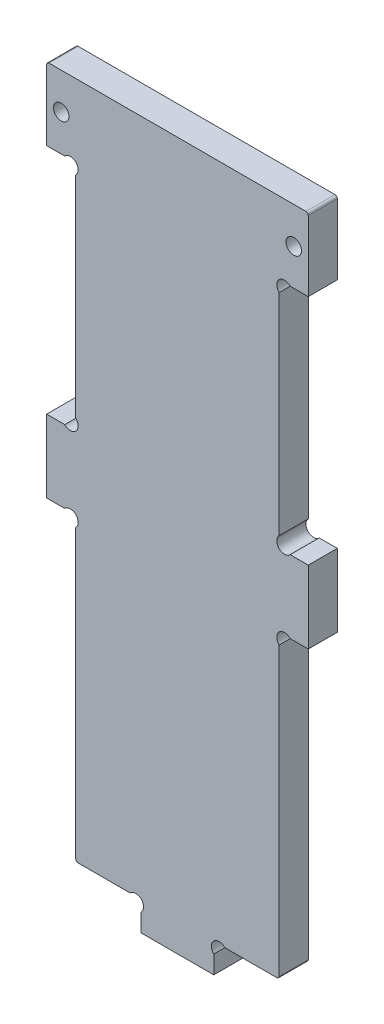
ISO-10303-21;
HEADER;
FILE_DESCRIPTION(('STEP AP214'),'2;1');
FILE_NAME('part.step','',(''),(''),'','','');
FILE_SCHEMA(('AUTOMOTIVE_DESIGN { 1 0 10303 214 1 1 1 1 }'));
ENDSEC;
DATA;
#1=APPLICATION_CONTEXT('core data for automotive mechanical design processes');
#2=APPLICATION_PROTOCOL_DEFINITION('international standard','automotive_design',2000,#1);
#3=PRODUCT_CONTEXT('',#1,'mechanical');
#4=PRODUCT('Part','Part','',(#3));
#5=PRODUCT_RELATED_PRODUCT_CATEGORY('part','',(#4));
#6=PRODUCT_DEFINITION_FORMATION('','',#4);
#7=PRODUCT_DEFINITION_CONTEXT('part definition',#1,'design');
#8=PRODUCT_DEFINITION('design','',#6,#7);
#9=PRODUCT_DEFINITION_SHAPE('','',#8);
#10=(LENGTH_UNIT() NAMED_UNIT(*) SI_UNIT(.MILLI.,.METRE.));
#11=(NAMED_UNIT(*) PLANE_ANGLE_UNIT() SI_UNIT($,.RADIAN.));
#12=(NAMED_UNIT(*) SI_UNIT($,.STERADIAN.) SOLID_ANGLE_UNIT());
#13=UNCERTAINTY_MEASURE_WITH_UNIT(LENGTH_MEASURE(1.E-05),#10,'distance_accuracy_value','');
#14=(GEOMETRIC_REPRESENTATION_CONTEXT(3) GLOBAL_UNCERTAINTY_ASSIGNED_CONTEXT((#13)) GLOBAL_UNIT_ASSIGNED_CONTEXT((#10,
#11,#12)) REPRESENTATION_CONTEXT('',''));
#15=CARTESIAN_POINT('',(0.,0.,0.));
#16=DIRECTION('',(0.,0.,1.));
#17=DIRECTION('',(1.,0.,0.));
#18=AXIS2_PLACEMENT_3D('',#15,#16,#17);
#19=CARTESIAN_POINT('',(-77.,7.,-6.));
#20=DIRECTION('',(-1.,0.,0.));
#21=DIRECTION('',(0.,0.,1.));
#22=AXIS2_PLACEMENT_3D('',#19,#20,#21);
#23=PLANE('',#22);
#24=DIRECTION('',(0.,-1.,0.));
#25=VECTOR('',#24,1.);
#26=CARTESIAN_POINT('',(-77.,7.,0.));
#27=LINE('',#26,#25);
#28=CARTESIAN_POINT('',(-77.,7.,0.));
#29=VERTEX_POINT('',#28);
#30=CARTESIAN_POINT('',(-77.,-8.,0.));
#31=VERTEX_POINT('',#30);
#32=EDGE_CURVE('E243',#29,#31,#27,.T.);
#33=ORIENTED_EDGE('',*,*,#32,.F.);
#34=DIRECTION('',(0.,0.,1.));
#35=VECTOR('',#34,1.);
#36=CARTESIAN_POINT('',(-77.,7.,-6.));
#37=LINE('',#36,#35);
#38=CARTESIAN_POINT('',(-77.,7.,-6.));
#39=VERTEX_POINT('',#38);
#40=EDGE_CURVE('E11',#39,#29,#37,.T.);
#41=ORIENTED_EDGE('',*,*,#40,.F.);
#42=DIRECTION('',(0.,-1.,0.));
#43=VECTOR('',#42,1.);
#44=CARTESIAN_POINT('',(-77.,7.,-6.));
#45=LINE('',#44,#43);
#46=CARTESIAN_POINT('',(-77.,-8.,-6.));
#47=VERTEX_POINT('',#46);
#48=EDGE_CURVE('E245',#39,#47,#45,.T.);
#49=ORIENTED_EDGE('',*,*,#48,.T.);
#50=DIRECTION('',(0.,0.,1.));
#51=VECTOR('',#50,1.);
#52=CARTESIAN_POINT('',(-77.,-8.,-6.));
#53=LINE('',#52,#51);
#54=EDGE_CURVE('E38',#47,#31,#53,.T.);
#55=ORIENTED_EDGE('',*,*,#54,.T.);
#56=EDGE_LOOP('',(#33,#41,#49,#55));
#57=FACE_BOUND('',#56,.T.);
#58=ADVANCED_FACE('F35',(#57),#23,.T.);
#59=CARTESIAN_POINT('',(-73.2618950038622,7.,-6.));
#60=DIRECTION('',(0.,1.,0.));
#61=DIRECTION('',(0.,0.,1.));
#62=AXIS2_PLACEMENT_3D('',#59,#60,#61);
#63=PLANE('',#62);
#64=DIRECTION('',(-1.,0.,0.));
#65=VECTOR('',#64,1.);
#66=CARTESIAN_POINT('',(-73.2618950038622,7.,0.));
#67=LINE('',#66,#65);
#68=CARTESIAN_POINT('',(-73.2618950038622,7.,0.));
#69=VERTEX_POINT('',#68);
#70=EDGE_CURVE('E261',#69,#29,#67,.T.);
#71=ORIENTED_EDGE('',*,*,#70,.F.);
#72=DIRECTION('',(0.,0.,1.));
#73=VECTOR('',#72,1.);
#74=CARTESIAN_POINT('',(-73.2618950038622,7.,-6.));
#75=LINE('',#74,#73);
#76=CARTESIAN_POINT('',(-73.2618950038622,7.,-6.));
#77=VERTEX_POINT('',#76);
#78=EDGE_CURVE('E43',#77,#69,#75,.T.);
#79=ORIENTED_EDGE('',*,*,#78,.F.);
#80=DIRECTION('',(-1.,0.,0.));
#81=VECTOR('',#80,1.);
#82=CARTESIAN_POINT('',(-73.2618950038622,7.,-6.));
#83=LINE('',#82,#81);
#84=EDGE_CURVE('E250',#77,#39,#83,.T.);
#85=ORIENTED_EDGE('',*,*,#84,.T.);
#86=ORIENTED_EDGE('',*,*,#40,.T.);
#87=EDGE_LOOP('',(#71,#79,#85,#86));
#88=FACE_BOUND('',#87,.T.);
#89=ADVANCED_FACE('F615',(#88),#63,.T.);
#90=CARTESIAN_POINT('',(-72.1,8.1,-6.));
#91=DIRECTION('',(0.,0.,1.));
#92=DIRECTION('',(1.,0.,0.));
#93=AXIS2_PLACEMENT_3D('',#90,#91,#92);
#94=CYLINDRICAL_SURFACE('',#93,1.6);
#95=CARTESIAN_POINT('',(-72.1,8.1,0.));
#96=DIRECTION('',(0.,0.,-1.));
#97=DIRECTION('',(-1.,0.,0.));
#98=AXIS2_PLACEMENT_3D('',#95,#96,#97);
#99=CIRCLE('',#98,1.6);
#100=CARTESIAN_POINT('',(-71.,9.26189500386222,0.));
#101=VERTEX_POINT('',#100);
#102=EDGE_CURVE('E351',#101,#69,#99,.T.);
#103=ORIENTED_EDGE('',*,*,#102,.F.);
#104=DIRECTION('',(0.,0.,1.));
#105=VECTOR('',#104,1.);
#106=CARTESIAN_POINT('',(-71.,9.26189500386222,-6.));
#107=LINE('',#106,#105);
#108=CARTESIAN_POINT('',(-71.,9.26189500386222,-6.));
#109=VERTEX_POINT('',#108);
#110=EDGE_CURVE('E445',#109,#101,#107,.T.);
#111=ORIENTED_EDGE('',*,*,#110,.F.);
#112=CARTESIAN_POINT('',(-72.1,8.1,-6.));
#113=DIRECTION('',(0.,0.,-1.));
#114=DIRECTION('',(-1.,0.,0.));
#115=AXIS2_PLACEMENT_3D('',#112,#113,#114);
#116=CIRCLE('',#115,1.6);
#117=EDGE_CURVE('E441',#109,#77,#116,.T.);
#118=ORIENTED_EDGE('',*,*,#117,.T.);
#119=ORIENTED_EDGE('',*,*,#78,.T.);
#120=EDGE_LOOP('',(#103,#111,#118,#119));
#121=FACE_BOUND('',#120,.T.);
#122=ADVANCED_FACE('F614',(#121),#94,.F.);
#123=CARTESIAN_POINT('',(-71.,52.7381049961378,-6.));
#124=DIRECTION('',(-1.,0.,0.));
#125=DIRECTION('',(0.,0.,1.));
#126=AXIS2_PLACEMENT_3D('',#123,#124,#125);
#127=PLANE('',#126);
#128=DIRECTION('',(0.,-1.,0.));
#129=VECTOR('',#128,1.);
#130=CARTESIAN_POINT('',(-71.,52.7381049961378,0.));
#131=LINE('',#130,#129);
#132=CARTESIAN_POINT('',(-71.,52.7381049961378,0.));
#133=VERTEX_POINT('',#132);
#134=EDGE_CURVE('E348',#133,#101,#131,.T.);
#135=ORIENTED_EDGE('',*,*,#134,.F.);
#136=DIRECTION('',(0.,0.,1.));
#137=VECTOR('',#136,1.);
#138=CARTESIAN_POINT('',(-71.,52.7381049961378,-6.));
#139=LINE('',#138,#137);
#140=CARTESIAN_POINT('',(-71.,52.7381049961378,-6.));
#141=VERTEX_POINT('',#140);
#142=EDGE_CURVE('E447',#141,#133,#139,.T.);
#143=ORIENTED_EDGE('',*,*,#142,.F.);
#144=DIRECTION('',(0.,-1.,0.));
#145=VECTOR('',#144,1.);
#146=CARTESIAN_POINT('',(-71.,52.7381049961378,-6.));
#147=LINE('',#146,#145);
#148=EDGE_CURVE('E438',#141,#109,#147,.T.);
#149=ORIENTED_EDGE('',*,*,#148,.T.);
#150=ORIENTED_EDGE('',*,*,#110,.T.);
#151=EDGE_LOOP('',(#135,#143,#149,#150));
#152=FACE_BOUND('',#151,.T.);
#153=ADVANCED_FACE('F610',(#152),#127,.T.);
#154=CARTESIAN_POINT('',(-72.1,53.9,-6.));
#155=DIRECTION('',(0.,0.,1.));
#156=DIRECTION('',(1.,0.,0.));
#157=AXIS2_PLACEMENT_3D('',#154,#155,#156);
#158=CYLINDRICAL_SURFACE('',#157,1.59999999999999);
#159=CARTESIAN_POINT('',(-72.1,53.9,0.));
#160=DIRECTION('',(0.,0.,-1.));
#161=DIRECTION('',(-1.,0.,0.));
#162=AXIS2_PLACEMENT_3D('',#159,#160,#161);
#163=CIRCLE('',#162,1.59999999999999);
#164=CARTESIAN_POINT('',(-73.2618950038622,55.,0.));
#165=VERTEX_POINT('',#164);
#166=EDGE_CURVE('E345',#165,#133,#163,.T.);
#167=ORIENTED_EDGE('',*,*,#166,.F.);
#168=DIRECTION('',(0.,0.,1.));
#169=VECTOR('',#168,1.);
#170=CARTESIAN_POINT('',(-73.2618950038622,55.,-6.));
#171=LINE('',#170,#169);
#172=CARTESIAN_POINT('',(-73.2618950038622,55.,-6.));
#173=VERTEX_POINT('',#172);
#174=EDGE_CURVE('E449',#173,#165,#171,.T.);
#175=ORIENTED_EDGE('',*,*,#174,.F.);
#176=CARTESIAN_POINT('',(-72.1,53.9,-6.));
#177=DIRECTION('',(0.,0.,-1.));
#178=DIRECTION('',(-1.,0.,0.));
#179=AXIS2_PLACEMENT_3D('',#176,#177,#178);
#180=CIRCLE('',#179,1.59999999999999);
#181=EDGE_CURVE('E435',#173,#141,#180,.T.);
#182=ORIENTED_EDGE('',*,*,#181,.T.);
#183=ORIENTED_EDGE('',*,*,#142,.T.);
#184=EDGE_LOOP('',(#167,#175,#182,#183));
#185=FACE_BOUND('',#184,.T.);
#186=ADVANCED_FACE('F606',(#185),#158,.F.);
#187=CARTESIAN_POINT('',(-77.,55.,-6.));
#188=DIRECTION('',(0.,-1.,0.));
#189=DIRECTION('',(0.,0.,-1.));
#190=AXIS2_PLACEMENT_3D('',#187,#188,#189);
#191=PLANE('',#190);
#192=DIRECTION('',(1.,0.,0.));
#193=VECTOR('',#192,1.);
#194=CARTESIAN_POINT('',(-77.,55.,0.));
#195=LINE('',#194,#193);
#196=CARTESIAN_POINT('',(-77.,55.,0.));
#197=VERTEX_POINT('',#196);
#198=EDGE_CURVE('E342',#197,#165,#195,.T.);
#199=ORIENTED_EDGE('',*,*,#198,.F.);
#200=DIRECTION('',(0.,0.,1.));
#201=VECTOR('',#200,1.);
#202=CARTESIAN_POINT('',(-77.,55.,-6.));
#203=LINE('',#202,#201);
#204=CARTESIAN_POINT('',(-77.,55.,-6.));
#205=VERTEX_POINT('',#204);
#206=EDGE_CURVE('E451',#205,#197,#203,.T.);
#207=ORIENTED_EDGE('',*,*,#206,.F.);
#208=DIRECTION('',(1.,0.,0.));
#209=VECTOR('',#208,1.);
#210=CARTESIAN_POINT('',(-77.,55.,-6.));
#211=LINE('',#210,#209);
#212=EDGE_CURVE('E432',#205,#173,#211,.T.);
#213=ORIENTED_EDGE('',*,*,#212,.T.);
#214=ORIENTED_EDGE('',*,*,#174,.T.);
#215=EDGE_LOOP('',(#199,#207,#213,#214));
#216=FACE_BOUND('',#215,.T.);
#217=ADVANCED_FACE('F602',(#216),#191,.T.);
#218=CARTESIAN_POINT('',(-77.,69.5,-6.));
#219=DIRECTION('',(-1.,0.,0.));
#220=DIRECTION('',(0.,0.,1.));
#221=AXIS2_PLACEMENT_3D('',#218,#219,#220);
#222=PLANE('',#221);
#223=DIRECTION('',(0.,-1.,0.));
#224=VECTOR('',#223,1.);
#225=CARTESIAN_POINT('',(-77.,69.5,0.));
#226=LINE('',#225,#224);
#227=CARTESIAN_POINT('',(-77.,69.5,0.));
#228=VERTEX_POINT('',#227);
#229=EDGE_CURVE('E339',#228,#197,#226,.T.);
#230=ORIENTED_EDGE('',*,*,#229,.F.);
#231=DIRECTION('',(0.,0.,1.));
#232=VECTOR('',#231,1.);
#233=CARTESIAN_POINT('',(-77.,69.5,-6.));
#234=LINE('',#233,#232);
#235=CARTESIAN_POINT('',(-77.,69.5,-6.));
#236=VERTEX_POINT('',#235);
#237=EDGE_CURVE('E453',#236,#228,#234,.T.);
#238=ORIENTED_EDGE('',*,*,#237,.F.);
#239=DIRECTION('',(0.,-1.,0.));
#240=VECTOR('',#239,1.);
#241=CARTESIAN_POINT('',(-77.,69.5,-6.));
#242=LINE('',#241,#240);
#243=EDGE_CURVE('E429',#236,#205,#242,.T.);
#244=ORIENTED_EDGE('',*,*,#243,.T.);
#245=ORIENTED_EDGE('',*,*,#206,.T.);
#246=EDGE_LOOP('',(#230,#238,#244,#245));
#247=FACE_BOUND('',#246,.T.);
#248=ADVANCED_FACE('F598',(#247),#222,.T.);
#249=CARTESIAN_POINT('',(-76.5,69.5,-6.));
#250=DIRECTION('',(0.,0.,1.));
#251=DIRECTION('',(1.,0.,0.));
#252=AXIS2_PLACEMENT_3D('',#249,#250,#251);
#253=CYLINDRICAL_SURFACE('',#252,0.5);
#254=CARTESIAN_POINT('',(-76.5,69.5,0.));
#255=DIRECTION('',(0.,0.,1.));
#256=DIRECTION('',(1.,0.,0.));
#257=AXIS2_PLACEMENT_3D('',#254,#255,#256);
#258=CIRCLE('',#257,0.5);
#259=CARTESIAN_POINT('',(-76.5,70.,0.));
#260=VERTEX_POINT('',#259);
#261=EDGE_CURVE('E336',#260,#228,#258,.T.);
#262=ORIENTED_EDGE('',*,*,#261,.F.);
#263=DIRECTION('',(0.,0.,1.));
#264=VECTOR('',#263,1.);
#265=CARTESIAN_POINT('',(-76.5,70.,-6.));
#266=LINE('',#265,#264);
#267=CARTESIAN_POINT('',(-76.5,70.,-6.));
#268=VERTEX_POINT('',#267);
#269=EDGE_CURVE('E455',#268,#260,#266,.T.);
#270=ORIENTED_EDGE('',*,*,#269,.F.);
#271=CARTESIAN_POINT('',(-76.5,69.5,-6.));
#272=DIRECTION('',(0.,0.,1.));
#273=DIRECTION('',(1.,0.,0.));
#274=AXIS2_PLACEMENT_3D('',#271,#272,#273);
#275=CIRCLE('',#274,0.5);
#276=EDGE_CURVE('E426',#268,#236,#275,.T.);
#277=ORIENTED_EDGE('',*,*,#276,.T.);
#278=ORIENTED_EDGE('',*,*,#237,.T.);
#279=EDGE_LOOP('',(#262,#270,#277,#278));
#280=FACE_BOUND('',#279,.T.);
#281=ADVANCED_FACE('F594',(#280),#253,.T.);
#282=CARTESIAN_POINT('',(-76.5,70.,-6.));
#283=DIRECTION('',(0.,1.,0.));
#284=DIRECTION('',(0.,0.,1.));
#285=AXIS2_PLACEMENT_3D('',#282,#283,#284);
#286=PLANE('',#285);
#287=DIRECTION('',(-1.,0.,0.));
#288=VECTOR('',#287,1.);
#289=CARTESIAN_POINT('',(-76.5,70.,0.));
#290=LINE('',#289,#288);
#291=CARTESIAN_POINT('',(-23.5,70.,0.));
#292=VERTEX_POINT('',#291);
#293=EDGE_CURVE('E333',#292,#260,#290,.T.);
#294=ORIENTED_EDGE('',*,*,#293,.F.);
#295=DIRECTION('',(0.,0.,1.));
#296=VECTOR('',#295,1.);
#297=CARTESIAN_POINT('',(-23.5,70.,-6.));
#298=LINE('',#297,#296);
#299=CARTESIAN_POINT('',(-23.5,70.,-6.));
#300=VERTEX_POINT('',#299);
#301=EDGE_CURVE('E457',#300,#292,#298,.T.);
#302=ORIENTED_EDGE('',*,*,#301,.F.);
#303=DIRECTION('',(-1.,0.,0.));
#304=VECTOR('',#303,1.);
#305=CARTESIAN_POINT('',(-76.5,70.,-6.));
#306=LINE('',#305,#304);
#307=EDGE_CURVE('E423',#300,#268,#306,.T.);
#308=ORIENTED_EDGE('',*,*,#307,.T.);
#309=ORIENTED_EDGE('',*,*,#269,.T.);
#310=EDGE_LOOP('',(#294,#302,#308,#309));
#311=FACE_BOUND('',#310,.T.);
#312=ADVANCED_FACE('F590',(#311),#286,.T.);
#313=CARTESIAN_POINT('',(-23.5,69.5,-6.));
#314=DIRECTION('',(0.,0.,1.));
#315=DIRECTION('',(1.,0.,0.));
#316=AXIS2_PLACEMENT_3D('',#313,#314,#315);
#317=CYLINDRICAL_SURFACE('',#316,0.5);
#318=CARTESIAN_POINT('',(-23.5,69.5,0.));
#319=DIRECTION('',(0.,0.,1.));
#320=DIRECTION('',(-1.,0.,0.));
#321=AXIS2_PLACEMENT_3D('',#318,#319,#320);
#322=CIRCLE('',#321,0.5);
#323=CARTESIAN_POINT('',(-23.,69.5,0.));
#324=VERTEX_POINT('',#323);
#325=EDGE_CURVE('E330',#324,#292,#322,.T.);
#326=ORIENTED_EDGE('',*,*,#325,.F.);
#327=DIRECTION('',(0.,0.,1.));
#328=VECTOR('',#327,1.);
#329=CARTESIAN_POINT('',(-23.,69.5,-6.));
#330=LINE('',#329,#328);
#331=CARTESIAN_POINT('',(-23.,69.5,-6.));
#332=VERTEX_POINT('',#331);
#333=EDGE_CURVE('E459',#332,#324,#330,.T.);
#334=ORIENTED_EDGE('',*,*,#333,.F.);
#335=CARTESIAN_POINT('',(-23.5,69.5,-6.));
#336=DIRECTION('',(0.,0.,1.));
#337=DIRECTION('',(-1.,0.,0.));
#338=AXIS2_PLACEMENT_3D('',#335,#336,#337);
#339=CIRCLE('',#338,0.5);
#340=EDGE_CURVE('E420',#332,#300,#339,.T.);
#341=ORIENTED_EDGE('',*,*,#340,.T.);
#342=ORIENTED_EDGE('',*,*,#301,.T.);
#343=EDGE_LOOP('',(#326,#334,#341,#342));
#344=FACE_BOUND('',#343,.T.);
#345=ADVANCED_FACE('F586',(#344),#317,.T.);
#346=CARTESIAN_POINT('',(-23.,69.5,-6.));
#347=DIRECTION('',(1.,0.,0.));
#348=DIRECTION('',(0.,0.,-1.));
#349=AXIS2_PLACEMENT_3D('',#346,#347,#348);
#350=PLANE('',#349);
#351=DIRECTION('',(0.,1.,0.));
#352=VECTOR('',#351,1.);
#353=CARTESIAN_POINT('',(-23.,69.5,0.));
#354=LINE('',#353,#352);
#355=CARTESIAN_POINT('',(-23.,55.,0.));
#356=VERTEX_POINT('',#355);
#357=EDGE_CURVE('E327',#356,#324,#354,.T.);
#358=ORIENTED_EDGE('',*,*,#357,.F.);
#359=DIRECTION('',(0.,0.,1.));
#360=VECTOR('',#359,1.);
#361=CARTESIAN_POINT('',(-23.,55.,-6.));
#362=LINE('',#361,#360);
#363=CARTESIAN_POINT('',(-23.,55.,-6.));
#364=VERTEX_POINT('',#363);
#365=EDGE_CURVE('E461',#364,#356,#362,.T.);
#366=ORIENTED_EDGE('',*,*,#365,.F.);
#367=DIRECTION('',(0.,1.,0.));
#368=VECTOR('',#367,1.);
#369=CARTESIAN_POINT('',(-23.,69.5,-6.));
#370=LINE('',#369,#368);
#371=EDGE_CURVE('E417',#364,#332,#370,.T.);
#372=ORIENTED_EDGE('',*,*,#371,.T.);
#373=ORIENTED_EDGE('',*,*,#333,.T.);
#374=EDGE_LOOP('',(#358,#366,#372,#373));
#375=FACE_BOUND('',#374,.T.);
#376=ADVANCED_FACE('F582',(#375),#350,.T.);
#377=CARTESIAN_POINT('',(-23.,55.,-6.));
#378=DIRECTION('',(0.,-1.,0.));
#379=DIRECTION('',(0.,0.,-1.));
#380=AXIS2_PLACEMENT_3D('',#377,#378,#379);
#381=PLANE('',#380);
#382=DIRECTION('',(1.,0.,0.));
#383=VECTOR('',#382,1.);
#384=CARTESIAN_POINT('',(-23.,55.,0.));
#385=LINE('',#384,#383);
#386=CARTESIAN_POINT('',(-26.7381049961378,55.,0.));
#387=VERTEX_POINT('',#386);
#388=EDGE_CURVE('E324',#387,#356,#385,.T.);
#389=ORIENTED_EDGE('',*,*,#388,.F.);
#390=DIRECTION('',(0.,0.,1.));
#391=VECTOR('',#390,1.);
#392=CARTESIAN_POINT('',(-26.7381049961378,55.,-6.));
#393=LINE('',#392,#391);
#394=CARTESIAN_POINT('',(-26.7381049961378,55.,-6.));
#395=VERTEX_POINT('',#394);
#396=EDGE_CURVE('E463',#395,#387,#393,.T.);
#397=ORIENTED_EDGE('',*,*,#396,.F.);
#398=DIRECTION('',(1.,0.,0.));
#399=VECTOR('',#398,1.);
#400=CARTESIAN_POINT('',(-23.,55.,-6.));
#401=LINE('',#400,#399);
#402=EDGE_CURVE('E414',#395,#364,#401,.T.);
#403=ORIENTED_EDGE('',*,*,#402,.T.);
#404=ORIENTED_EDGE('',*,*,#365,.T.);
#405=EDGE_LOOP('',(#389,#397,#403,#404));
#406=FACE_BOUND('',#405,.T.);
#407=ADVANCED_FACE('F578',(#406),#381,.T.);
#408=CARTESIAN_POINT('',(-27.9,53.9,-6.));
#409=DIRECTION('',(0.,0.,1.));
#410=DIRECTION('',(1.,0.,0.));
#411=AXIS2_PLACEMENT_3D('',#408,#409,#410);
#412=CYLINDRICAL_SURFACE('',#411,1.59999999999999);
#413=CARTESIAN_POINT('',(-27.9,53.9,0.));
#414=DIRECTION('',(0.,0.,-1.));
#415=DIRECTION('',(1.,0.,0.));
#416=AXIS2_PLACEMENT_3D('',#413,#414,#415);
#417=CIRCLE('',#416,1.59999999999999);
#418=CARTESIAN_POINT('',(-29.,52.7381049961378,0.));
#419=VERTEX_POINT('',#418);
#420=EDGE_CURVE('E321',#419,#387,#417,.T.);
#421=ORIENTED_EDGE('',*,*,#420,.F.);
#422=DIRECTION('',(0.,0.,1.));
#423=VECTOR('',#422,1.);
#424=CARTESIAN_POINT('',(-29.,52.7381049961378,-6.));
#425=LINE('',#424,#423);
#426=CARTESIAN_POINT('',(-29.,52.7381049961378,-6.));
#427=VERTEX_POINT('',#426);
#428=EDGE_CURVE('E465',#427,#419,#425,.T.);
#429=ORIENTED_EDGE('',*,*,#428,.F.);
#430=CARTESIAN_POINT('',(-27.9,53.9,-6.));
#431=DIRECTION('',(0.,0.,-1.));
#432=DIRECTION('',(1.,0.,0.));
#433=AXIS2_PLACEMENT_3D('',#430,#431,#432);
#434=CIRCLE('',#433,1.59999999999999);
#435=EDGE_CURVE('E411',#427,#395,#434,.T.);
#436=ORIENTED_EDGE('',*,*,#435,.T.);
#437=ORIENTED_EDGE('',*,*,#396,.T.);
#438=EDGE_LOOP('',(#421,#429,#436,#437));
#439=FACE_BOUND('',#438,.T.);
#440=ADVANCED_FACE('F574',(#439),#412,.F.);
#441=CARTESIAN_POINT('',(-29.,52.7381049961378,-6.));
#442=DIRECTION('',(1.,0.,0.));
#443=DIRECTION('',(0.,1.,0.));
#444=AXIS2_PLACEMENT_3D('',#441,#442,#443);
#445=PLANE('',#444);
#446=DIRECTION('',(0.,1.,0.));
#447=VECTOR('',#446,1.);
#448=CARTESIAN_POINT('',(-29.,52.7381049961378,0.));
#449=LINE('',#448,#447);
#450=CARTESIAN_POINT('',(-29.,9.26189500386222,0.));
#451=VERTEX_POINT('',#450);
#452=EDGE_CURVE('E318',#451,#419,#449,.T.);
#453=ORIENTED_EDGE('',*,*,#452,.F.);
#454=DIRECTION('',(0.,0.,1.));
#455=VECTOR('',#454,1.);
#456=CARTESIAN_POINT('',(-29.,9.26189500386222,-6.));
#457=LINE('',#456,#455);
#458=CARTESIAN_POINT('',(-29.,9.26189500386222,-6.));
#459=VERTEX_POINT('',#458);
#460=EDGE_CURVE('E467',#459,#451,#457,.T.);
#461=ORIENTED_EDGE('',*,*,#460,.F.);
#462=DIRECTION('',(0.,1.,0.));
#463=VECTOR('',#462,1.);
#464=CARTESIAN_POINT('',(-29.,52.7381049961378,-6.));
#465=LINE('',#464,#463);
#466=EDGE_CURVE('E408',#459,#427,#465,.T.);
#467=ORIENTED_EDGE('',*,*,#466,.T.);
#468=ORIENTED_EDGE('',*,*,#428,.T.);
#469=EDGE_LOOP('',(#453,#461,#467,#468));
#470=FACE_BOUND('',#469,.T.);
#471=ADVANCED_FACE('F570',(#470),#445,.T.);
#472=CARTESIAN_POINT('',(-27.9,8.1,-6.));
#473=DIRECTION('',(0.,0.,1.));
#474=DIRECTION('',(1.,0.,0.));
#475=AXIS2_PLACEMENT_3D('',#472,#473,#474);
#476=CYLINDRICAL_SURFACE('',#475,1.6);
#477=CARTESIAN_POINT('',(-27.9,8.1,0.));
#478=DIRECTION('',(0.,0.,-1.));
#479=DIRECTION('',(1.,0.,0.));
#480=AXIS2_PLACEMENT_3D('',#477,#478,#479);
#481=CIRCLE('',#480,1.6);
#482=CARTESIAN_POINT('',(-26.7381049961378,7.,0.));
#483=VERTEX_POINT('',#482);
#484=EDGE_CURVE('E315',#483,#451,#481,.T.);
#485=ORIENTED_EDGE('',*,*,#484,.F.);
#486=DIRECTION('',(0.,0.,1.));
#487=VECTOR('',#486,1.);
#488=CARTESIAN_POINT('',(-26.7381049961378,7.,-6.));
#489=LINE('',#488,#487);
#490=CARTESIAN_POINT('',(-26.7381049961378,7.,-6.));
#491=VERTEX_POINT('',#490);
#492=EDGE_CURVE('E469',#491,#483,#489,.T.);
#493=ORIENTED_EDGE('',*,*,#492,.F.);
#494=CARTESIAN_POINT('',(-27.9,8.1,-6.));
#495=DIRECTION('',(0.,0.,-1.));
#496=DIRECTION('',(1.,0.,0.));
#497=AXIS2_PLACEMENT_3D('',#494,#495,#496);
#498=CIRCLE('',#497,1.6);
#499=EDGE_CURVE('E405',#491,#459,#498,.T.);
#500=ORIENTED_EDGE('',*,*,#499,.T.);
#501=ORIENTED_EDGE('',*,*,#460,.T.);
#502=EDGE_LOOP('',(#485,#493,#500,#501));
#503=FACE_BOUND('',#502,.T.);
#504=ADVANCED_FACE('F566',(#503),#476,.F.);
#505=CARTESIAN_POINT('',(-26.7381049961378,7.,-6.));
#506=DIRECTION('',(0.,1.,0.));
#507=DIRECTION('',(0.,0.,1.));
#508=AXIS2_PLACEMENT_3D('',#505,#506,#507);
#509=PLANE('',#508);
#510=DIRECTION('',(-1.,0.,0.));
#511=VECTOR('',#510,1.);
#512=CARTESIAN_POINT('',(-26.7381049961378,7.,0.));
#513=LINE('',#512,#511);
#514=CARTESIAN_POINT('',(-23.,7.,0.));
#515=VERTEX_POINT('',#514);
#516=EDGE_CURVE('E312',#515,#483,#513,.T.);
#517=ORIENTED_EDGE('',*,*,#516,.F.);
#518=DIRECTION('',(0.,0.,1.));
#519=VECTOR('',#518,1.);
#520=CARTESIAN_POINT('',(-23.,7.,-6.));
#521=LINE('',#520,#519);
#522=CARTESIAN_POINT('',(-23.,7.,-6.));
#523=VERTEX_POINT('',#522);
#524=EDGE_CURVE('E471',#523,#515,#521,.T.);
#525=ORIENTED_EDGE('',*,*,#524,.F.);
#526=DIRECTION('',(-1.,0.,0.));
#527=VECTOR('',#526,1.);
#528=CARTESIAN_POINT('',(-26.7381049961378,7.,-6.));
#529=LINE('',#528,#527);
#530=EDGE_CURVE('E402',#523,#491,#529,.T.);
#531=ORIENTED_EDGE('',*,*,#530,.T.);
#532=ORIENTED_EDGE('',*,*,#492,.T.);
#533=EDGE_LOOP('',(#517,#525,#531,#532));
#534=FACE_BOUND('',#533,.T.);
#535=ADVANCED_FACE('F562',(#534),#509,.T.);
#536=CARTESIAN_POINT('',(-23.,7.,-6.));
#537=DIRECTION('',(1.,0.,0.));
#538=DIRECTION('',(0.,0.,-1.));
#539=AXIS2_PLACEMENT_3D('',#536,#537,#538);
#540=PLANE('',#539);
#541=DIRECTION('',(0.,1.,0.));
#542=VECTOR('',#541,1.);
#543=CARTESIAN_POINT('',(-23.,7.,0.));
#544=LINE('',#543,#542);
#545=CARTESIAN_POINT('',(-23.,-8.,0.));
#546=VERTEX_POINT('',#545);
#547=EDGE_CURVE('E309',#546,#515,#544,.T.);
#548=ORIENTED_EDGE('',*,*,#547,.F.);
#549=DIRECTION('',(0.,0.,1.));
#550=VECTOR('',#549,1.);
#551=CARTESIAN_POINT('',(-23.,-8.,-6.));
#552=LINE('',#551,#550);
#553=CARTESIAN_POINT('',(-23.,-8.,-6.));
#554=VERTEX_POINT('',#553);
#555=EDGE_CURVE('E473',#554,#546,#552,.T.);
#556=ORIENTED_EDGE('',*,*,#555,.F.);
#557=DIRECTION('',(0.,1.,0.));
#558=VECTOR('',#557,1.);
#559=CARTESIAN_POINT('',(-23.,7.,-6.));
#560=LINE('',#559,#558);
#561=EDGE_CURVE('E399',#554,#523,#560,.T.);
#562=ORIENTED_EDGE('',*,*,#561,.T.);
#563=ORIENTED_EDGE('',*,*,#524,.T.);
#564=EDGE_LOOP('',(#548,#556,#562,#563));
#565=FACE_BOUND('',#564,.T.);
#566=ADVANCED_FACE('F558',(#565),#540,.T.);
#567=CARTESIAN_POINT('',(-23.,-8.,-6.));
#568=DIRECTION('',(0.,-1.,0.));
#569=DIRECTION('',(0.,0.,-1.));
#570=AXIS2_PLACEMENT_3D('',#567,#568,#569);
#571=PLANE('',#570);
#572=DIRECTION('',(1.,0.,0.));
#573=VECTOR('',#572,1.);
#574=CARTESIAN_POINT('',(-23.,-8.,0.));
#575=LINE('',#574,#573);
#576=CARTESIAN_POINT('',(-26.7381049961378,-8.,0.));
#577=VERTEX_POINT('',#576);
#578=EDGE_CURVE('E306',#577,#546,#575,.T.);
#579=ORIENTED_EDGE('',*,*,#578,.F.);
#580=DIRECTION('',(0.,0.,1.));
#581=VECTOR('',#580,1.);
#582=CARTESIAN_POINT('',(-26.7381049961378,-8.,-6.));
#583=LINE('',#582,#581);
#584=CARTESIAN_POINT('',(-26.7381049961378,-8.,-6.));
#585=VERTEX_POINT('',#584);
#586=EDGE_CURVE('E475',#585,#577,#583,.T.);
#587=ORIENTED_EDGE('',*,*,#586,.F.);
#588=DIRECTION('',(1.,0.,0.));
#589=VECTOR('',#588,1.);
#590=CARTESIAN_POINT('',(-23.,-8.,-6.));
#591=LINE('',#590,#589);
#592=EDGE_CURVE('E396',#585,#554,#591,.T.);
#593=ORIENTED_EDGE('',*,*,#592,.T.);
#594=ORIENTED_EDGE('',*,*,#555,.T.);
#595=EDGE_LOOP('',(#579,#587,#593,#594));
#596=FACE_BOUND('',#595,.T.);
#597=ADVANCED_FACE('F554',(#596),#571,.T.);
#598=CARTESIAN_POINT('',(-27.9,-9.1,-6.));
#599=DIRECTION('',(0.,0.,1.));
#600=DIRECTION('',(1.,0.,0.));
#601=AXIS2_PLACEMENT_3D('',#598,#599,#600);
#602=CYLINDRICAL_SURFACE('',#601,1.6);
#603=CARTESIAN_POINT('',(-27.9,-9.1,0.));
#604=DIRECTION('',(0.,0.,-1.));
#605=DIRECTION('',(-1.,0.,0.));
#606=AXIS2_PLACEMENT_3D('',#603,#604,#605);
#607=CIRCLE('',#606,1.6);
#608=CARTESIAN_POINT('',(-29.,-10.2618950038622,0.));
#609=VERTEX_POINT('',#608);
#610=EDGE_CURVE('E303',#609,#577,#607,.T.);
#611=ORIENTED_EDGE('',*,*,#610,.F.);
#612=DIRECTION('',(0.,0.,1.));
#613=VECTOR('',#612,1.);
#614=CARTESIAN_POINT('',(-29.,-10.2618950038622,-6.));
#615=LINE('',#614,#613);
#616=CARTESIAN_POINT('',(-29.,-10.2618950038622,-6.));
#617=VERTEX_POINT('',#616);
#618=EDGE_CURVE('E477',#617,#609,#615,.T.);
#619=ORIENTED_EDGE('',*,*,#618,.F.);
#620=CARTESIAN_POINT('',(-27.9,-9.1,-6.));
#621=DIRECTION('',(0.,0.,-1.));
#622=DIRECTION('',(-1.,0.,0.));
#623=AXIS2_PLACEMENT_3D('',#620,#621,#622);
#624=CIRCLE('',#623,1.6);
#625=EDGE_CURVE('E393',#617,#585,#624,.T.);
#626=ORIENTED_EDGE('',*,*,#625,.T.);
#627=ORIENTED_EDGE('',*,*,#586,.T.);
#628=EDGE_LOOP('',(#611,#619,#626,#627));
#629=FACE_BOUND('',#628,.T.);
#630=ADVANCED_FACE('F550',(#629),#602,.F.);
#631=CARTESIAN_POINT('',(-29.,-10.2618950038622,-6.));
#632=DIRECTION('',(1.,0.,0.));
#633=DIRECTION('',(0.,1.,0.));
#634=AXIS2_PLACEMENT_3D('',#631,#632,#633);
#635=PLANE('',#634);
#636=DIRECTION('',(0.,1.,0.));
#637=VECTOR('',#636,1.);
#638=CARTESIAN_POINT('',(-29.,-10.2618950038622,0.));
#639=LINE('',#638,#637);
#640=CARTESIAN_POINT('',(-29.,-69.5,0.));
#641=VERTEX_POINT('',#640);
#642=EDGE_CURVE('E300',#641,#609,#639,.T.);
#643=ORIENTED_EDGE('',*,*,#642,.F.);
#644=DIRECTION('',(0.,0.,1.));
#645=VECTOR('',#644,1.);
#646=CARTESIAN_POINT('',(-29.,-69.5,-6.));
#647=LINE('',#646,#645);
#648=CARTESIAN_POINT('',(-29.,-69.5,-6.));
#649=VERTEX_POINT('',#648);
#650=EDGE_CURVE('E479',#649,#641,#647,.T.);
#651=ORIENTED_EDGE('',*,*,#650,.F.);
#652=DIRECTION('',(0.,1.,0.));
#653=VECTOR('',#652,1.);
#654=CARTESIAN_POINT('',(-29.,-10.2618950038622,-6.));
#655=LINE('',#654,#653);
#656=EDGE_CURVE('E390',#649,#617,#655,.T.);
#657=ORIENTED_EDGE('',*,*,#656,.T.);
#658=ORIENTED_EDGE('',*,*,#618,.T.);
#659=EDGE_LOOP('',(#643,#651,#657,#658));
#660=FACE_BOUND('',#659,.T.);
#661=ADVANCED_FACE('F546',(#660),#635,.T.);
#662=CARTESIAN_POINT('',(-29.5,-69.5,-6.));
#663=DIRECTION('',(0.,0.,1.));
#664=DIRECTION('',(1.,0.,0.));
#665=AXIS2_PLACEMENT_3D('',#662,#663,#664);
#666=CYLINDRICAL_SURFACE('',#665,0.5);
#667=CARTESIAN_POINT('',(-29.5,-69.5,0.));
#668=DIRECTION('',(0.,0.,1.));
#669=DIRECTION('',(-1.,0.,0.));
#670=AXIS2_PLACEMENT_3D('',#667,#668,#669);
#671=CIRCLE('',#670,0.5);
#672=CARTESIAN_POINT('',(-29.5,-70.,0.));
#673=VERTEX_POINT('',#672);
#674=EDGE_CURVE('E297',#673,#641,#671,.T.);
#675=ORIENTED_EDGE('',*,*,#674,.F.);
#676=DIRECTION('',(0.,0.,1.));
#677=VECTOR('',#676,1.);
#678=CARTESIAN_POINT('',(-29.5,-70.,-6.));
#679=LINE('',#678,#677);
#680=CARTESIAN_POINT('',(-29.5,-70.,-6.));
#681=VERTEX_POINT('',#680);
#682=EDGE_CURVE('E481',#681,#673,#679,.T.);
#683=ORIENTED_EDGE('',*,*,#682,.F.);
#684=CARTESIAN_POINT('',(-29.5,-69.5,-6.));
#685=DIRECTION('',(0.,0.,1.));
#686=DIRECTION('',(-1.,0.,0.));
#687=AXIS2_PLACEMENT_3D('',#684,#685,#686);
#688=CIRCLE('',#687,0.5);
#689=EDGE_CURVE('E387',#681,#649,#688,.T.);
#690=ORIENTED_EDGE('',*,*,#689,.T.);
#691=ORIENTED_EDGE('',*,*,#650,.T.);
#692=EDGE_LOOP('',(#675,#683,#690,#691));
#693=FACE_BOUND('',#692,.T.);
#694=ADVANCED_FACE('F542',(#693),#666,.T.);
#695=CARTESIAN_POINT('',(-29.5,-70.,-6.));
#696=DIRECTION('',(0.,-1.,0.));
#697=DIRECTION('',(0.,0.,-1.));
#698=AXIS2_PLACEMENT_3D('',#695,#696,#697);
#699=PLANE('',#698);
#700=DIRECTION('',(1.,0.,0.));
#701=VECTOR('',#700,1.);
#702=CARTESIAN_POINT('',(-29.5,-70.,0.));
#703=LINE('',#702,#701);
#704=CARTESIAN_POINT('',(-40.2381049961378,-70.,0.));
#705=VERTEX_POINT('',#704);
#706=EDGE_CURVE('E294',#705,#673,#703,.T.);
#707=ORIENTED_EDGE('',*,*,#706,.F.);
#708=DIRECTION('',(0.,0.,1.));
#709=VECTOR('',#708,1.);
#710=CARTESIAN_POINT('',(-40.2381049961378,-70.,-6.));
#711=LINE('',#710,#709);
#712=CARTESIAN_POINT('',(-40.2381049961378,-70.,-6.));
#713=VERTEX_POINT('',#712);
#714=EDGE_CURVE('E483',#713,#705,#711,.T.);
#715=ORIENTED_EDGE('',*,*,#714,.F.);
#716=DIRECTION('',(1.,0.,0.));
#717=VECTOR('',#716,1.);
#718=CARTESIAN_POINT('',(-29.5,-70.,-6.));
#719=LINE('',#718,#717);
#720=EDGE_CURVE('E384',#713,#681,#719,.T.);
#721=ORIENTED_EDGE('',*,*,#720,.T.);
#722=ORIENTED_EDGE('',*,*,#682,.T.);
#723=EDGE_LOOP('',(#707,#715,#721,#722));
#724=FACE_BOUND('',#723,.T.);
#725=ADVANCED_FACE('F538',(#724),#699,.T.);
#726=CARTESIAN_POINT('',(-41.4,-71.1,-6.));
#727=DIRECTION('',(0.,0.,1.));
#728=DIRECTION('',(1.,0.,0.));
#729=AXIS2_PLACEMENT_3D('',#726,#727,#728);
#730=CYLINDRICAL_SURFACE('',#729,1.6);
#731=CARTESIAN_POINT('',(-41.4,-71.1,0.));
#732=DIRECTION('',(0.,0.,-1.));
#733=DIRECTION('',(1.,0.,0.));
#734=AXIS2_PLACEMENT_3D('',#731,#732,#733);
#735=CIRCLE('',#734,1.6);
#736=CARTESIAN_POINT('',(-42.5,-72.2618950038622,0.));
#737=VERTEX_POINT('',#736);
#738=EDGE_CURVE('E291',#737,#705,#735,.T.);
#739=ORIENTED_EDGE('',*,*,#738,.F.);
#740=DIRECTION('',(0.,0.,1.));
#741=VECTOR('',#740,1.);
#742=CARTESIAN_POINT('',(-42.5,-72.2618950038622,-6.));
#743=LINE('',#742,#741);
#744=CARTESIAN_POINT('',(-42.5,-72.2618950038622,-6.));
#745=VERTEX_POINT('',#744);
#746=EDGE_CURVE('E485',#745,#737,#743,.T.);
#747=ORIENTED_EDGE('',*,*,#746,.F.);
#748=CARTESIAN_POINT('',(-41.4,-71.1,-6.));
#749=DIRECTION('',(0.,0.,-1.));
#750=DIRECTION('',(1.,0.,0.));
#751=AXIS2_PLACEMENT_3D('',#748,#749,#750);
#752=CIRCLE('',#751,1.6);
#753=EDGE_CURVE('E381',#745,#713,#752,.T.);
#754=ORIENTED_EDGE('',*,*,#753,.T.);
#755=ORIENTED_EDGE('',*,*,#714,.T.);
#756=EDGE_LOOP('',(#739,#747,#754,#755));
#757=FACE_BOUND('',#756,.T.);
#758=ADVANCED_FACE('F534',(#757),#730,.F.);
#759=CARTESIAN_POINT('',(-42.5,-72.2618950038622,-6.));
#760=DIRECTION('',(1.,0.,0.));
#761=DIRECTION('',(0.,1.,0.));
#762=AXIS2_PLACEMENT_3D('',#759,#760,#761);
#763=PLANE('',#762);
#764=DIRECTION('',(0.,1.,0.));
#765=VECTOR('',#764,1.);
#766=CARTESIAN_POINT('',(-42.5,-72.2618950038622,0.));
#767=LINE('',#766,#765);
#768=CARTESIAN_POINT('',(-42.5,-76.,0.));
#769=VERTEX_POINT('',#768);
#770=EDGE_CURVE('E288',#769,#737,#767,.T.);
#771=ORIENTED_EDGE('',*,*,#770,.F.);
#772=DIRECTION('',(0.,0.,1.));
#773=VECTOR('',#772,1.);
#774=CARTESIAN_POINT('',(-42.5,-76.,-6.));
#775=LINE('',#774,#773);
#776=CARTESIAN_POINT('',(-42.5,-76.,-6.));
#777=VERTEX_POINT('',#776);
#778=EDGE_CURVE('E487',#777,#769,#775,.T.);
#779=ORIENTED_EDGE('',*,*,#778,.F.);
#780=DIRECTION('',(0.,1.,0.));
#781=VECTOR('',#780,1.);
#782=CARTESIAN_POINT('',(-42.5,-72.2618950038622,-6.));
#783=LINE('',#782,#781);
#784=EDGE_CURVE('E378',#777,#745,#783,.T.);
#785=ORIENTED_EDGE('',*,*,#784,.T.);
#786=ORIENTED_EDGE('',*,*,#746,.T.);
#787=EDGE_LOOP('',(#771,#779,#785,#786));
#788=FACE_BOUND('',#787,.T.);
#789=ADVANCED_FACE('F530',(#788),#763,.T.);
#790=CARTESIAN_POINT('',(-42.5,-76.,-6.));
#791=DIRECTION('',(0.,-1.,0.));
#792=DIRECTION('',(0.,0.,-1.));
#793=AXIS2_PLACEMENT_3D('',#790,#791,#792);
#794=PLANE('',#793);
#795=DIRECTION('',(1.,0.,0.));
#796=VECTOR('',#795,1.);
#797=CARTESIAN_POINT('',(-42.5,-76.,0.));
#798=LINE('',#797,#796);
#799=CARTESIAN_POINT('',(-57.5,-76.,0.));
#800=VERTEX_POINT('',#799);
#801=EDGE_CURVE('E285',#800,#769,#798,.T.);
#802=ORIENTED_EDGE('',*,*,#801,.F.);
#803=DIRECTION('',(0.,0.,1.));
#804=VECTOR('',#803,1.);
#805=CARTESIAN_POINT('',(-57.5,-76.,-6.));
#806=LINE('',#805,#804);
#807=CARTESIAN_POINT('',(-57.5,-76.,-6.));
#808=VERTEX_POINT('',#807);
#809=EDGE_CURVE('E489',#808,#800,#806,.T.);
#810=ORIENTED_EDGE('',*,*,#809,.F.);
#811=DIRECTION('',(1.,0.,0.));
#812=VECTOR('',#811,1.);
#813=CARTESIAN_POINT('',(-42.5,-76.,-6.));
#814=LINE('',#813,#812);
#815=EDGE_CURVE('E375',#808,#777,#814,.T.);
#816=ORIENTED_EDGE('',*,*,#815,.T.);
#817=ORIENTED_EDGE('',*,*,#778,.T.);
#818=EDGE_LOOP('',(#802,#810,#816,#817));
#819=FACE_BOUND('',#818,.T.);
#820=ADVANCED_FACE('F526',(#819),#794,.T.);
#821=CARTESIAN_POINT('',(-57.5,-72.2618950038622,-6.));
#822=DIRECTION('',(-1.,0.,0.));
#823=DIRECTION('',(0.,-1.,0.));
#824=AXIS2_PLACEMENT_3D('',#821,#822,#823);
#825=PLANE('',#824);
#826=DIRECTION('',(0.,-1.,0.));
#827=VECTOR('',#826,1.);
#828=CARTESIAN_POINT('',(-57.5,-72.2618950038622,0.));
#829=LINE('',#828,#827);
#830=CARTESIAN_POINT('',(-57.5,-72.2618950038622,0.));
#831=VERTEX_POINT('',#830);
#832=EDGE_CURVE('E282',#831,#800,#829,.T.);
#833=ORIENTED_EDGE('',*,*,#832,.F.);
#834=DIRECTION('',(0.,0.,1.));
#835=VECTOR('',#834,1.);
#836=CARTESIAN_POINT('',(-57.5,-72.2618950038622,-6.));
#837=LINE('',#836,#835);
#838=CARTESIAN_POINT('',(-57.5,-72.2618950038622,-6.));
#839=VERTEX_POINT('',#838);
#840=EDGE_CURVE('E491',#839,#831,#837,.T.);
#841=ORIENTED_EDGE('',*,*,#840,.F.);
#842=DIRECTION('',(0.,-1.,0.));
#843=VECTOR('',#842,1.);
#844=CARTESIAN_POINT('',(-57.5,-72.2618950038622,-6.));
#845=LINE('',#844,#843);
#846=EDGE_CURVE('E372',#839,#808,#845,.T.);
#847=ORIENTED_EDGE('',*,*,#846,.T.);
#848=ORIENTED_EDGE('',*,*,#809,.T.);
#849=EDGE_LOOP('',(#833,#841,#847,#848));
#850=FACE_BOUND('',#849,.T.);
#851=ADVANCED_FACE('F522',(#850),#825,.T.);
#852=CARTESIAN_POINT('',(-58.6,-71.1,-6.));
#853=DIRECTION('',(0.,0.,1.));
#854=DIRECTION('',(1.,0.,0.));
#855=AXIS2_PLACEMENT_3D('',#852,#853,#854);
#856=CYLINDRICAL_SURFACE('',#855,1.6);
#857=CARTESIAN_POINT('',(-58.6,-71.1,0.));
#858=DIRECTION('',(0.,0.,-1.));
#859=DIRECTION('',(-1.,0.,0.));
#860=AXIS2_PLACEMENT_3D('',#857,#858,#859);
#861=CIRCLE('',#860,1.6);
#862=CARTESIAN_POINT('',(-59.7618950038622,-70.,0.));
#863=VERTEX_POINT('',#862);
#864=EDGE_CURVE('E279',#863,#831,#861,.T.);
#865=ORIENTED_EDGE('',*,*,#864,.F.);
#866=DIRECTION('',(0.,0.,1.));
#867=VECTOR('',#866,1.);
#868=CARTESIAN_POINT('',(-59.7618950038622,-70.,-6.));
#869=LINE('',#868,#867);
#870=CARTESIAN_POINT('',(-59.7618950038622,-70.,-6.));
#871=VERTEX_POINT('',#870);
#872=EDGE_CURVE('E493',#871,#863,#869,.T.);
#873=ORIENTED_EDGE('',*,*,#872,.F.);
#874=CARTESIAN_POINT('',(-58.6,-71.1,-6.));
#875=DIRECTION('',(0.,0.,-1.));
#876=DIRECTION('',(-1.,0.,0.));
#877=AXIS2_PLACEMENT_3D('',#874,#875,#876);
#878=CIRCLE('',#877,1.6);
#879=EDGE_CURVE('E369',#871,#839,#878,.T.);
#880=ORIENTED_EDGE('',*,*,#879,.T.);
#881=ORIENTED_EDGE('',*,*,#840,.T.);
#882=EDGE_LOOP('',(#865,#873,#880,#881));
#883=FACE_BOUND('',#882,.T.);
#884=ADVANCED_FACE('F518',(#883),#856,.F.);
#885=CARTESIAN_POINT('',(-70.5,-70.,-6.));
#886=DIRECTION('',(0.,-1.,0.));
#887=DIRECTION('',(0.,0.,-1.));
#888=AXIS2_PLACEMENT_3D('',#885,#886,#887);
#889=PLANE('',#888);
#890=DIRECTION('',(1.,0.,0.));
#891=VECTOR('',#890,1.);
#892=CARTESIAN_POINT('',(-70.5,-70.,0.));
#893=LINE('',#892,#891);
#894=CARTESIAN_POINT('',(-70.5,-70.,0.));
#895=VERTEX_POINT('',#894);
#896=EDGE_CURVE('E276',#895,#863,#893,.T.);
#897=ORIENTED_EDGE('',*,*,#896,.F.);
#898=DIRECTION('',(0.,0.,1.));
#899=VECTOR('',#898,1.);
#900=CARTESIAN_POINT('',(-70.5,-70.,-6.));
#901=LINE('',#900,#899);
#902=CARTESIAN_POINT('',(-70.5,-70.,-6.));
#903=VERTEX_POINT('',#902);
#904=EDGE_CURVE('E495',#903,#895,#901,.T.);
#905=ORIENTED_EDGE('',*,*,#904,.F.);
#906=DIRECTION('',(1.,0.,0.));
#907=VECTOR('',#906,1.);
#908=CARTESIAN_POINT('',(-70.5,-70.,-6.));
#909=LINE('',#908,#907);
#910=EDGE_CURVE('E366',#903,#871,#909,.T.);
#911=ORIENTED_EDGE('',*,*,#910,.T.);
#912=ORIENTED_EDGE('',*,*,#872,.T.);
#913=EDGE_LOOP('',(#897,#905,#911,#912));
#914=FACE_BOUND('',#913,.T.);
#915=ADVANCED_FACE('F514',(#914),#889,.T.);
#916=CARTESIAN_POINT('',(-70.5,-69.5,-6.));
#917=DIRECTION('',(0.,0.,1.));
#918=DIRECTION('',(1.,0.,0.));
#919=AXIS2_PLACEMENT_3D('',#916,#917,#918);
#920=CYLINDRICAL_SURFACE('',#919,0.5);
#921=CARTESIAN_POINT('',(-70.5,-69.5,0.));
#922=DIRECTION('',(0.,0.,1.));
#923=DIRECTION('',(1.,0.,0.));
#924=AXIS2_PLACEMENT_3D('',#921,#922,#923);
#925=CIRCLE('',#924,0.5);
#926=CARTESIAN_POINT('',(-71.,-69.5,0.));
#927=VERTEX_POINT('',#926);
#928=EDGE_CURVE('E273',#927,#895,#925,.T.);
#929=ORIENTED_EDGE('',*,*,#928,.F.);
#930=DIRECTION('',(0.,0.,1.));
#931=VECTOR('',#930,1.);
#932=CARTESIAN_POINT('',(-71.,-69.5,-6.));
#933=LINE('',#932,#931);
#934=CARTESIAN_POINT('',(-71.,-69.5,-6.));
#935=VERTEX_POINT('',#934);
#936=EDGE_CURVE('E497',#935,#927,#933,.T.);
#937=ORIENTED_EDGE('',*,*,#936,.F.);
#938=CARTESIAN_POINT('',(-70.5,-69.5,-6.));
#939=DIRECTION('',(0.,0.,1.));
#940=DIRECTION('',(1.,0.,0.));
#941=AXIS2_PLACEMENT_3D('',#938,#939,#940);
#942=CIRCLE('',#941,0.5);
#943=EDGE_CURVE('E363',#935,#903,#942,.T.);
#944=ORIENTED_EDGE('',*,*,#943,.T.);
#945=ORIENTED_EDGE('',*,*,#904,.T.);
#946=EDGE_LOOP('',(#929,#937,#944,#945));
#947=FACE_BOUND('',#946,.T.);
#948=ADVANCED_FACE('F510',(#947),#920,.T.);
#949=CARTESIAN_POINT('',(-71.,-10.2618950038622,-6.));
#950=DIRECTION('',(-1.,0.,0.));
#951=DIRECTION('',(0.,-1.,0.));
#952=AXIS2_PLACEMENT_3D('',#949,#950,#951);
#953=PLANE('',#952);
#954=DIRECTION('',(0.,-1.,0.));
#955=VECTOR('',#954,1.);
#956=CARTESIAN_POINT('',(-71.,-10.2618950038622,0.));
#957=LINE('',#956,#955);
#958=CARTESIAN_POINT('',(-71.,-10.2618950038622,0.));
#959=VERTEX_POINT('',#958);
#960=EDGE_CURVE('E270',#959,#927,#957,.T.);
#961=ORIENTED_EDGE('',*,*,#960,.F.);
#962=DIRECTION('',(0.,0.,1.));
#963=VECTOR('',#962,1.);
#964=CARTESIAN_POINT('',(-71.,-10.2618950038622,-6.));
#965=LINE('',#964,#963);
#966=CARTESIAN_POINT('',(-71.,-10.2618950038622,-6.));
#967=VERTEX_POINT('',#966);
#968=EDGE_CURVE('E499',#967,#959,#965,.T.);
#969=ORIENTED_EDGE('',*,*,#968,.F.);
#970=DIRECTION('',(0.,-1.,0.));
#971=VECTOR('',#970,1.);
#972=CARTESIAN_POINT('',(-71.,-10.2618950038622,-6.));
#973=LINE('',#972,#971);
#974=EDGE_CURVE('E360',#967,#935,#973,.T.);
#975=ORIENTED_EDGE('',*,*,#974,.T.);
#976=ORIENTED_EDGE('',*,*,#936,.T.);
#977=EDGE_LOOP('',(#961,#969,#975,#976));
#978=FACE_BOUND('',#977,.T.);
#979=ADVANCED_FACE('F506',(#978),#953,.T.);
#980=CARTESIAN_POINT('',(-72.1,-9.1,-6.));
#981=DIRECTION('',(0.,0.,1.));
#982=DIRECTION('',(1.,0.,0.));
#983=AXIS2_PLACEMENT_3D('',#980,#981,#982);
#984=CYLINDRICAL_SURFACE('',#983,1.60000000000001);
#985=CARTESIAN_POINT('',(-72.1,-9.1,0.));
#986=DIRECTION('',(0.,0.,-1.));
#987=DIRECTION('',(1.,0.,0.));
#988=AXIS2_PLACEMENT_3D('',#985,#986,#987);
#989=CIRCLE('',#988,1.60000000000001);
#990=CARTESIAN_POINT('',(-73.2618950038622,-8.,0.));
#991=VERTEX_POINT('',#990);
#992=EDGE_CURVE('E257',#991,#959,#989,.T.);
#993=ORIENTED_EDGE('',*,*,#992,.F.);
#994=DIRECTION('',(0.,0.,1.));
#995=VECTOR('',#994,1.);
#996=CARTESIAN_POINT('',(-73.2618950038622,-8.,-6.));
#997=LINE('',#996,#995);
#998=CARTESIAN_POINT('',(-73.2618950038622,-8.,-6.));
#999=VERTEX_POINT('',#998);
#1000=EDGE_CURVE('E249',#999,#991,#997,.T.);
#1001=ORIENTED_EDGE('',*,*,#1000,.F.);
#1002=CARTESIAN_POINT('',(-72.1,-9.1,-6.));
#1003=DIRECTION('',(0.,0.,-1.));
#1004=DIRECTION('',(1.,0.,0.));
#1005=AXIS2_PLACEMENT_3D('',#1002,#1003,#1004);
#1006=CIRCLE('',#1005,1.60000000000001);
#1007=EDGE_CURVE('E357',#999,#967,#1006,.T.);
#1008=ORIENTED_EDGE('',*,*,#1007,.T.);
#1009=ORIENTED_EDGE('',*,*,#968,.T.);
#1010=EDGE_LOOP('',(#993,#1001,#1008,#1009));
#1011=FACE_BOUND('',#1010,.T.);
#1012=ADVANCED_FACE('F502',(#1011),#984,.F.);
#1013=CARTESIAN_POINT('',(-77.,-8.,-6.));
#1014=DIRECTION('',(0.,-1.,0.));
#1015=DIRECTION('',(0.,0.,-1.));
#1016=AXIS2_PLACEMENT_3D('',#1013,#1014,#1015);
#1017=PLANE('',#1016);
#1018=DIRECTION('',(1.,0.,0.));
#1019=VECTOR('',#1018,1.);
#1020=CARTESIAN_POINT('',(-77.,-8.,0.));
#1021=LINE('',#1020,#1019);
#1022=EDGE_CURVE('E252',#31,#991,#1021,.T.);
#1023=ORIENTED_EDGE('',*,*,#1022,.F.);
#1024=ORIENTED_EDGE('',*,*,#54,.F.);
#1025=DIRECTION('',(1.,0.,0.));
#1026=VECTOR('',#1025,1.);
#1027=CARTESIAN_POINT('',(-77.,-8.,-6.));
#1028=LINE('',#1027,#1026);
#1029=EDGE_CURVE('E355',#47,#999,#1028,.T.);
#1030=ORIENTED_EDGE('',*,*,#1029,.T.);
#1031=ORIENTED_EDGE('',*,*,#1000,.T.);
#1032=EDGE_LOOP('',(#1023,#1024,#1030,#1031));
#1033=FACE_BOUND('',#1032,.T.);
#1034=ADVANCED_FACE('F253',(#1033),#1017,.T.);
#1035=CARTESIAN_POINT('',(-72.1,-9.1,-6.));
#1036=DIRECTION('',(0.,0.,1.));
#1037=DIRECTION('',(1.,0.,0.));
#1038=AXIS2_PLACEMENT_3D('',#1035,#1036,#1037);
#1039=PLANE('',#1038);
#1040=CARTESIAN_POINT('',(-74.,62.5,-6.));
#1041=DIRECTION('',(0.,0.,1.));
#1042=DIRECTION('',(-1.,0.,0.));
#1043=AXIS2_PLACEMENT_3D('',#1040,#1041,#1042);
#1044=CIRCLE('',#1043,1.60000000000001);
#1045=CARTESIAN_POINT('',(-75.6,62.5,-6.));
#1046=VERTEX_POINT('',#1045);
#1047=EDGE_CURVE('E739',#1046,#1046,#1044,.T.);
#1048=ORIENTED_EDGE('',*,*,#1047,.T.);
#1049=EDGE_LOOP('',(#1048));
#1050=FACE_BOUND('',#1049,.T.);
#1051=CARTESIAN_POINT('',(-26.,62.5,-6.));
#1052=DIRECTION('',(0.,0.,1.));
#1053=DIRECTION('',(1.,0.,0.));
#1054=AXIS2_PLACEMENT_3D('',#1051,#1052,#1053);
#1055=CIRCLE('',#1054,1.6);
#1056=CARTESIAN_POINT('',(-24.4,62.5,-6.));
#1057=VERTEX_POINT('',#1056);
#1058=EDGE_CURVE('E262',#1057,#1057,#1055,.T.);
#1059=ORIENTED_EDGE('',*,*,#1058,.T.);
#1060=EDGE_LOOP('',(#1059));
#1061=FACE_BOUND('',#1060,.T.);
#1062=ORIENTED_EDGE('',*,*,#48,.F.);
#1063=ORIENTED_EDGE('',*,*,#84,.F.);
#1064=ORIENTED_EDGE('',*,*,#117,.F.);
#1065=ORIENTED_EDGE('',*,*,#148,.F.);
#1066=ORIENTED_EDGE('',*,*,#181,.F.);
#1067=ORIENTED_EDGE('',*,*,#212,.F.);
#1068=ORIENTED_EDGE('',*,*,#243,.F.);
#1069=ORIENTED_EDGE('',*,*,#276,.F.);
#1070=ORIENTED_EDGE('',*,*,#307,.F.);
#1071=ORIENTED_EDGE('',*,*,#340,.F.);
#1072=ORIENTED_EDGE('',*,*,#371,.F.);
#1073=ORIENTED_EDGE('',*,*,#402,.F.);
#1074=ORIENTED_EDGE('',*,*,#435,.F.);
#1075=ORIENTED_EDGE('',*,*,#466,.F.);
#1076=ORIENTED_EDGE('',*,*,#499,.F.);
#1077=ORIENTED_EDGE('',*,*,#530,.F.);
#1078=ORIENTED_EDGE('',*,*,#561,.F.);
#1079=ORIENTED_EDGE('',*,*,#592,.F.);
#1080=ORIENTED_EDGE('',*,*,#625,.F.);
#1081=ORIENTED_EDGE('',*,*,#656,.F.);
#1082=ORIENTED_EDGE('',*,*,#689,.F.);
#1083=ORIENTED_EDGE('',*,*,#720,.F.);
#1084=ORIENTED_EDGE('',*,*,#753,.F.);
#1085=ORIENTED_EDGE('',*,*,#784,.F.);
#1086=ORIENTED_EDGE('',*,*,#815,.F.);
#1087=ORIENTED_EDGE('',*,*,#846,.F.);
#1088=ORIENTED_EDGE('',*,*,#879,.F.);
#1089=ORIENTED_EDGE('',*,*,#910,.F.);
#1090=ORIENTED_EDGE('',*,*,#943,.F.);
#1091=ORIENTED_EDGE('',*,*,#974,.F.);
#1092=ORIENTED_EDGE('',*,*,#1007,.F.);
#1093=ORIENTED_EDGE('',*,*,#1029,.F.);
#1094=EDGE_LOOP('',(#1062,#1063,#1064,#1065,#1066,#1067,#1068,#1069,#1070,#1071,#1072,#1073,
#1074,#1075,#1076,#1077,#1078,#1079,#1080,#1081,#1082,#1083,#1084,#1085,#1086,#1087,#1088,#1089,
#1090,#1091,#1092,#1093));
#1095=FACE_BOUND('',#1094,.T.);
#1096=ADVANCED_FACE('F618',(#1050,#1061,#1095),#1039,.F.);
#1097=CARTESIAN_POINT('',(-72.1,-9.1,0.));
#1098=DIRECTION('',(0.,0.,1.));
#1099=DIRECTION('',(1.,0.,0.));
#1100=AXIS2_PLACEMENT_3D('',#1097,#1098,#1099);
#1101=PLANE('',#1100);
#1102=CARTESIAN_POINT('',(-74.,62.5,0.));
#1103=DIRECTION('',(0.,0.,1.));
#1104=DIRECTION('',(-1.,0.,0.));
#1105=AXIS2_PLACEMENT_3D('',#1102,#1103,#1104);
#1106=CIRCLE('',#1105,1.60000000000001);
#1107=CARTESIAN_POINT('',(-75.6,62.5,0.));
#1108=VERTEX_POINT('',#1107);
#1109=EDGE_CURVE('E742',#1108,#1108,#1106,.T.);
#1110=ORIENTED_EDGE('',*,*,#1109,.F.);
#1111=EDGE_LOOP('',(#1110));
#1112=FACE_BOUND('',#1111,.T.);
#1113=CARTESIAN_POINT('',(-26.,62.5,0.));
#1114=DIRECTION('',(0.,0.,1.));
#1115=DIRECTION('',(1.,0.,0.));
#1116=AXIS2_PLACEMENT_3D('',#1113,#1114,#1115);
#1117=CIRCLE('',#1116,1.6);
#1118=CARTESIAN_POINT('',(-24.4,62.5,0.));
#1119=VERTEX_POINT('',#1118);
#1120=EDGE_CURVE('E265',#1119,#1119,#1117,.T.);
#1121=ORIENTED_EDGE('',*,*,#1120,.F.);
#1122=EDGE_LOOP('',(#1121));
#1123=FACE_BOUND('',#1122,.T.);
#1124=ORIENTED_EDGE('',*,*,#32,.T.);
#1125=ORIENTED_EDGE('',*,*,#1022,.T.);
#1126=ORIENTED_EDGE('',*,*,#992,.T.);
#1127=ORIENTED_EDGE('',*,*,#960,.T.);
#1128=ORIENTED_EDGE('',*,*,#928,.T.);
#1129=ORIENTED_EDGE('',*,*,#896,.T.);
#1130=ORIENTED_EDGE('',*,*,#864,.T.);
#1131=ORIENTED_EDGE('',*,*,#832,.T.);
#1132=ORIENTED_EDGE('',*,*,#801,.T.);
#1133=ORIENTED_EDGE('',*,*,#770,.T.);
#1134=ORIENTED_EDGE('',*,*,#738,.T.);
#1135=ORIENTED_EDGE('',*,*,#706,.T.);
#1136=ORIENTED_EDGE('',*,*,#674,.T.);
#1137=ORIENTED_EDGE('',*,*,#642,.T.);
#1138=ORIENTED_EDGE('',*,*,#610,.T.);
#1139=ORIENTED_EDGE('',*,*,#578,.T.);
#1140=ORIENTED_EDGE('',*,*,#547,.T.);
#1141=ORIENTED_EDGE('',*,*,#516,.T.);
#1142=ORIENTED_EDGE('',*,*,#484,.T.);
#1143=ORIENTED_EDGE('',*,*,#452,.T.);
#1144=ORIENTED_EDGE('',*,*,#420,.T.);
#1145=ORIENTED_EDGE('',*,*,#388,.T.);
#1146=ORIENTED_EDGE('',*,*,#357,.T.);
#1147=ORIENTED_EDGE('',*,*,#325,.T.);
#1148=ORIENTED_EDGE('',*,*,#293,.T.);
#1149=ORIENTED_EDGE('',*,*,#261,.T.);
#1150=ORIENTED_EDGE('',*,*,#229,.T.);
#1151=ORIENTED_EDGE('',*,*,#198,.T.);
#1152=ORIENTED_EDGE('',*,*,#166,.T.);
#1153=ORIENTED_EDGE('',*,*,#134,.T.);
#1154=ORIENTED_EDGE('',*,*,#102,.T.);
#1155=ORIENTED_EDGE('',*,*,#70,.T.);
#1156=EDGE_LOOP('',(#1124,#1125,#1126,#1127,#1128,#1129,#1130,#1131,#1132,#1133,#1134,#1135,
#1136,#1137,#1138,#1139,#1140,#1141,#1142,#1143,#1144,#1145,#1146,#1147,#1148,#1149,#1150,#1151,
#1152,#1153,#1154,#1155));
#1157=FACE_BOUND('',#1156,.T.);
#1158=ADVANCED_FACE('F259',(#1112,#1123,#1157),#1101,.T.);
#1159=CARTESIAN_POINT('',(-26.,62.5,-6.));
#1160=DIRECTION('',(0.,0.,1.));
#1161=DIRECTION('',(1.,0.,0.));
#1162=AXIS2_PLACEMENT_3D('',#1159,#1160,#1161);
#1163=CYLINDRICAL_SURFACE('',#1162,1.6);
#1164=ORIENTED_EDGE('',*,*,#1058,.F.);
#1165=EDGE_LOOP('',(#1164));
#1166=FACE_BOUND('',#1165,.T.);
#1167=ORIENTED_EDGE('',*,*,#1120,.T.);
#1168=EDGE_LOOP('',(#1167));
#1169=FACE_BOUND('',#1168,.T.);
#1170=ADVANCED_FACE('F626',(#1166,#1169),#1163,.F.);
#1171=CARTESIAN_POINT('',(-74.,62.5,-6.));
#1172=DIRECTION('',(0.,0.,1.));
#1173=DIRECTION('',(1.,0.,0.));
#1174=AXIS2_PLACEMENT_3D('',#1171,#1172,#1173);
#1175=CYLINDRICAL_SURFACE('',#1174,1.60000000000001);
#1176=ORIENTED_EDGE('',*,*,#1047,.F.);
#1177=EDGE_LOOP('',(#1176));
#1178=FACE_BOUND('',#1177,.T.);
#1179=ORIENTED_EDGE('',*,*,#1109,.T.);
#1180=EDGE_LOOP('',(#1179));
#1181=FACE_BOUND('',#1180,.T.);
#1182=ADVANCED_FACE('F723',(#1178,#1181),#1175,.F.);
#1183=CLOSED_SHELL('',(#58,#89,#122,#153,#186,#217,#248,#281,#312,#345,#376,#407,#440,#471,#504,
#535,#566,#597,#630,#661,#694,#725,#758,#789,#820,#851,#884,#915,#948,#979,#1012,#1034,#1096,
#1158,#1170,#1182));
#1184=MANIFOLD_SOLID_BREP('B2',#1183);
#1185=ADVANCED_BREP_SHAPE_REPRESENTATION('',(#18,#1184),#14);
#1186=SHAPE_DEFINITION_REPRESENTATION(#9,#1185);
ENDSEC;
END-ISO-10303-21;
